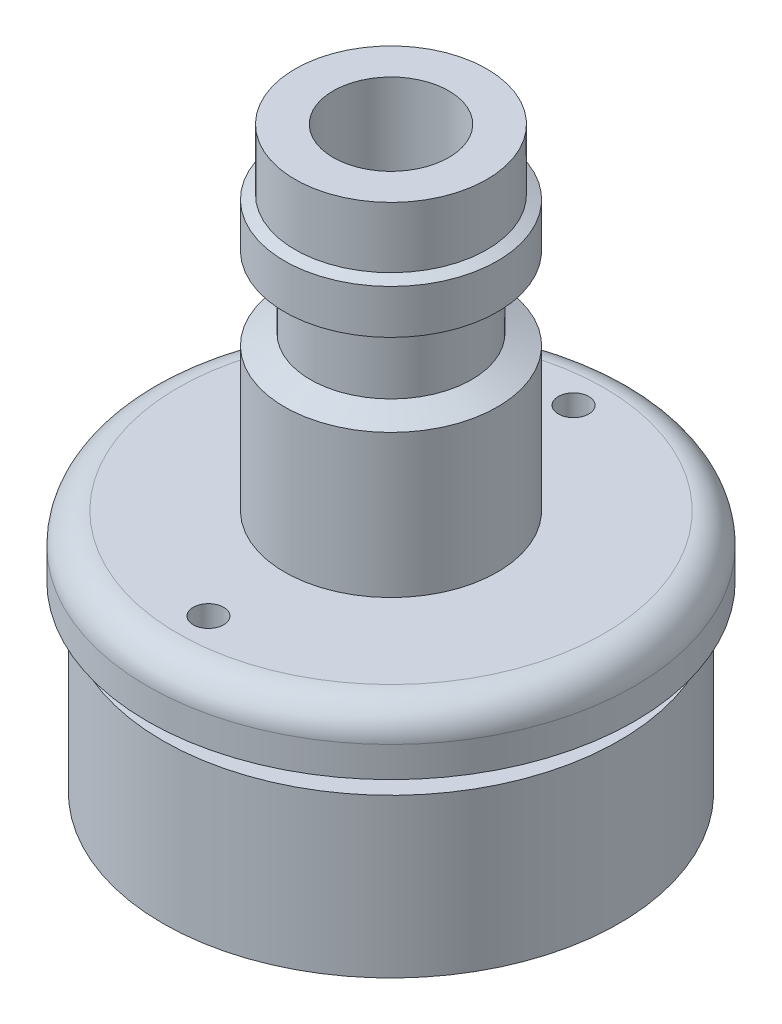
from build123d import *

# Parameters (mm, degrees)
SKETCH1_R           = 9.525
SHAFT_DEPTH         = 7.62
SKETCH11_R          = 9.779
SKETCH11_R_2        = 8.509
THREAD_RECESS_DEPTH = 1.016
SKETCH13_R          = 7.1374
LARGE_HOLE_DEPTH    = 22.886783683
SKETCH14_R          = 2.413
SMALL_HOLE_DEPTH    = 22.886783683
CHAMFER1_SIZE       = 1.778
SKETCH15_R          = 0.635
TOOL_HOLES_DEPTH    = 1.524


with BuildPart() as part:
    # Sketch1 → Shaft (new body)
    with BuildSketch(Plane(origin=(0, 0, 0), x_dir=(1, 0, 0), z_dir=(0, 1, 0))):
        with Locations(Location((0, 0, 0), (0, 0, 270))):
            Circle(SKETCH1_R)
    extrude(amount=-SHAFT_DEPTH)

    # Sketch11 → Thread Recess (cut)
    with BuildSketch(Plane(origin=(0, 0, 0), x_dir=(1, 0, 0), z_dir=(0, 1, 0))):
        Circle(SKETCH11_R)
        with Locations(Location((0, 0, 0), (0, 0, 270))):
            Circle(SKETCH11_R_2, mode=Mode.SUBTRACT)
    extrude(amount=-THREAD_RECESS_DEPTH, mode=Mode.SUBTRACT)

    # Sketch12 → Standard Connector (revolve)
    with BuildSketch(Plane.XY, mode=Mode.PRIVATE) as standard_connector_sk:
        with BuildLine():
            Line((0, 0), (10.16, 0))
            Line((10.16, 0), (10.16, 1.27))
            ThreePointArc((10.16, 1.27), (9.788025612, 2.168025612), (8.89, 2.54))
            Line((8.89, 2.54), (4.445, 2.54))
            Line((4.445, 2.54), (4.445, 8.509))
            Line((4.445, 8.509), (3.3655, 8.956143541))
            Line((3.3655, 8.956143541), (3.3655, 11.496143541))
            Line((3.3655, 11.496143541), (4.445, 11.943287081))
            Line((4.445, 11.943287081), (4.445, 13.785882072))
            Line((4.445, 13.785882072), (4.0005, 13.97))
            Line((4.0005, 13.97), (4.0005, 16.51))
            Line((4.0005, 16.51), (0, 16.51))
            Line((0, 16.51), (0, 0))
        make_face()
    revolve(standard_connector_sk.sketch.rotate(Axis((0, 0, 0), (0, 1, 0)), 90), axis=Axis((0, 0, 0), (0, 1, 0)))

    # Sketch13 → Large Hole (cut, through all)
    with BuildSketch(Plane(origin=(0, 0, 0), x_dir=(1, 0, 0), z_dir=(0, 1, 0))):
        with Locations(Location((0, 0, 0), (0, 0, 270))):
            Circle(SKETCH13_R)
    extrude(amount=-LARGE_HOLE_DEPTH, mode=Mode.SUBTRACT)

    # Sketch14 → Small Hole (cut, through all)
    with BuildSketch(Plane(origin=(0, 0, 0), x_dir=(1, 0, 0), z_dir=(0, 1, 0))):
        with Locations(Location((0, 0, 0), (0, 0, 270))):
            Circle(SKETCH14_R)
    extrude(amount=SMALL_HOLE_DEPTH, mode=Mode.SUBTRACT)

    # Chamfer1
    chamfer1_edges = [part.edges().sort_by_distance(p)[0] for p in [
        (0, 0, -2.413),
    ]]
    chamfer(chamfer1_edges, length=CHAMFER1_SIZE)

    # Sketch15 → Tool Holes (cut)
    with BuildSketch(Plane(origin=(0, 2.54, 0), x_dir=(-1, 0, 0), z_dir=(0, 1, 0))):
        with Locations(Location((0, -7.62, 0), (0, 0, 90))):
            Circle(SKETCH15_R)
        with Locations(Location((0, 7.62, 0), (0, 0, 270))):
            Circle(SKETCH15_R)
    extrude(amount=-TOOL_HOLES_DEPTH, mode=Mode.SUBTRACT)


solid = part.part
